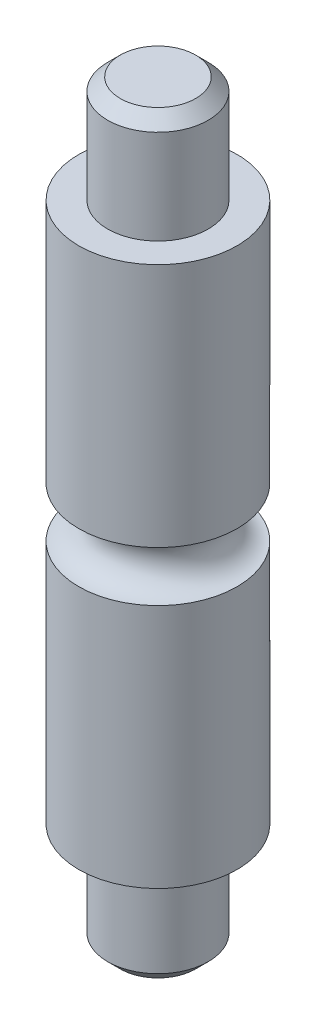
ISO-10303-21;
HEADER;
FILE_DESCRIPTION(('STEP AP214'),'2;1');
FILE_NAME('part.step','',(''),(''),'','','');
FILE_SCHEMA(('AUTOMOTIVE_DESIGN { 1 0 10303 214 1 1 1 1 }'));
ENDSEC;
DATA;
#1=APPLICATION_CONTEXT('core data for automotive mechanical design processes');
#2=APPLICATION_PROTOCOL_DEFINITION('international standard','automotive_design',2000,#1);
#3=PRODUCT_CONTEXT('',#1,'mechanical');
#4=PRODUCT('Part','Part','',(#3));
#5=PRODUCT_RELATED_PRODUCT_CATEGORY('part','',(#4));
#6=PRODUCT_DEFINITION_FORMATION('','',#4);
#7=PRODUCT_DEFINITION_CONTEXT('part definition',#1,'design');
#8=PRODUCT_DEFINITION('design','',#6,#7);
#9=PRODUCT_DEFINITION_SHAPE('','',#8);
#10=(LENGTH_UNIT() NAMED_UNIT(*) SI_UNIT(.MILLI.,.METRE.));
#11=(NAMED_UNIT(*) PLANE_ANGLE_UNIT() SI_UNIT($,.RADIAN.));
#12=(NAMED_UNIT(*) SI_UNIT($,.STERADIAN.) SOLID_ANGLE_UNIT());
#13=UNCERTAINTY_MEASURE_WITH_UNIT(LENGTH_MEASURE(1.E-05),#10,'distance_accuracy_value','');
#14=(GEOMETRIC_REPRESENTATION_CONTEXT(3) GLOBAL_UNCERTAINTY_ASSIGNED_CONTEXT((#13)) GLOBAL_UNIT_ASSIGNED_CONTEXT((#10,
#11,#12)) REPRESENTATION_CONTEXT('',''));
#15=CARTESIAN_POINT('',(0.,0.,0.));
#16=DIRECTION('',(0.,0.,1.));
#17=DIRECTION('',(1.,0.,0.));
#18=AXIS2_PLACEMENT_3D('',#15,#16,#17);
#19=CARTESIAN_POINT('',(0.,-10.75,0.));
#20=DIRECTION('',(0.,1.,0.));
#21=DIRECTION('',(0.,0.,1.));
#22=AXIS2_PLACEMENT_3D('',#19,#20,#21);
#23=CYLINDRICAL_SURFACE('',#22,3.15);
#24=CARTESIAN_POINT('',(0.,-0.999999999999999,0.));
#25=DIRECTION('',(0.,1.,0.));
#26=DIRECTION('',(0.,0.,1.));
#27=AXIS2_PLACEMENT_3D('',#24,#25,#26);
#28=CIRCLE('',#27,3.15);
#29=CARTESIAN_POINT('',(0.,-0.999999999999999,3.15));
#30=VERTEX_POINT('',#29);
#31=EDGE_CURVE('E34',#30,#30,#28,.T.);
#32=ORIENTED_EDGE('',*,*,#31,.F.);
#33=EDGE_LOOP('',(#32));
#34=FACE_BOUND('',#33,.T.);
#35=CARTESIAN_POINT('',(0.,-10.75,0.));
#36=DIRECTION('',(0.,1.,0.));
#37=DIRECTION('',(0.,0.,1.));
#38=AXIS2_PLACEMENT_3D('',#35,#36,#37);
#39=CIRCLE('',#38,3.15);
#40=CARTESIAN_POINT('',(0.,-10.75,3.15));
#41=VERTEX_POINT('',#40);
#42=EDGE_CURVE('E65',#41,#41,#39,.T.);
#43=ORIENTED_EDGE('',*,*,#42,.T.);
#44=EDGE_LOOP('',(#43));
#45=FACE_BOUND('',#44,.T.);
#46=ADVANCED_FACE('F30',(#34,#45),#23,.T.);
#47=CARTESIAN_POINT('',(0.,-10.75,0.));
#48=DIRECTION('',(0.,1.,0.));
#49=DIRECTION('',(0.,0.,1.));
#50=AXIS2_PLACEMENT_3D('',#47,#48,#49);
#51=PLANE('',#50);
#52=CARTESIAN_POINT('',(0.,-10.75,0.));
#53=DIRECTION('',(0.,1.,0.));
#54=DIRECTION('',(0.,0.,1.));
#55=AXIS2_PLACEMENT_3D('',#52,#53,#54);
#56=CIRCLE('',#55,2.);
#57=CARTESIAN_POINT('',(0.,-10.75,2.));
#58=VERTEX_POINT('',#57);
#59=EDGE_CURVE('E51',#58,#58,#56,.T.);
#60=ORIENTED_EDGE('',*,*,#59,.T.);
#61=EDGE_LOOP('',(#60));
#62=FACE_BOUND('',#61,.T.);
#63=ORIENTED_EDGE('',*,*,#42,.F.);
#64=EDGE_LOOP('',(#63));
#65=FACE_BOUND('',#64,.T.);
#66=ADVANCED_FACE('F84',(#62,#65),#51,.F.);
#67=CARTESIAN_POINT('',(0.,-15.,0.));
#68=DIRECTION('',(0.,1.,0.));
#69=DIRECTION('',(0.,0.,1.));
#70=AXIS2_PLACEMENT_3D('',#67,#68,#69);
#71=CYLINDRICAL_SURFACE('',#70,2.);
#72=CARTESIAN_POINT('',(0.,-14.5,0.));
#73=DIRECTION('',(0.,-1.,0.));
#74=DIRECTION('',(0.,0.,-1.));
#75=AXIS2_PLACEMENT_3D('',#72,#73,#74);
#76=CIRCLE('',#75,2.);
#77=CARTESIAN_POINT('',(0.,-14.5,-2.));
#78=VERTEX_POINT('',#77);
#79=EDGE_CURVE('E68',#78,#78,#76,.F.);
#80=ORIENTED_EDGE('',*,*,#79,.T.);
#81=EDGE_LOOP('',(#80));
#82=FACE_BOUND('',#81,.T.);
#83=ORIENTED_EDGE('',*,*,#59,.F.);
#84=EDGE_LOOP('',(#83));
#85=FACE_BOUND('',#84,.T.);
#86=ADVANCED_FACE('F81',(#82,#85),#71,.T.);
#87=CARTESIAN_POINT('',(0.,-15.,0.));
#88=DIRECTION('',(0.,-1.,0.));
#89=DIRECTION('',(0.,0.,1.));
#90=AXIS2_PLACEMENT_3D('',#87,#88,#89);
#91=PLANE('',#90);
#92=CARTESIAN_POINT('',(0.,-15.,0.));
#93=DIRECTION('',(0.,-1.,0.));
#94=DIRECTION('',(0.,0.,-1.));
#95=AXIS2_PLACEMENT_3D('',#92,#93,#94);
#96=CIRCLE('',#95,1.5);
#97=CARTESIAN_POINT('',(0.,-15.,-1.5));
#98=VERTEX_POINT('',#97);
#99=EDGE_CURVE('E43',#98,#98,#96,.T.);
#100=ORIENTED_EDGE('',*,*,#99,.T.);
#101=EDGE_LOOP('',(#100));
#102=FACE_BOUND('',#101,.T.);
#103=ADVANCED_FACE('F73',(#102),#91,.T.);
#104=CARTESIAN_POINT('',(0.,-14.5,0.));
#105=DIRECTION('',(0.,1.,0.));
#106=DIRECTION('',(0.,0.,1.));
#107=AXIS2_PLACEMENT_3D('',#104,#105,#106);
#108=CONICAL_SURFACE('',#107,2.,0.785398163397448);
#109=ORIENTED_EDGE('',*,*,#99,.F.);
#110=EDGE_LOOP('',(#109));
#111=FACE_BOUND('',#110,.T.);
#112=ORIENTED_EDGE('',*,*,#79,.F.);
#113=EDGE_LOOP('',(#112));
#114=FACE_BOUND('',#113,.T.);
#115=ADVANCED_FACE('F75',(#111,#114),#108,.T.);
#116=CARTESIAN_POINT('',(0.,0.,0.));
#117=DIRECTION('',(0.,-1.,0.));
#118=DIRECTION('',(0.,0.,-1.));
#119=AXIS2_PLACEMENT_3D('',#116,#117,#118);
#120=TOROIDAL_SURFACE('',#119,3.15,0.999999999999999);
#121=ORIENTED_EDGE('',*,*,#31,.T.);
#122=EDGE_LOOP('',(#121));
#123=FACE_BOUND('',#122,.T.);
#124=CARTESIAN_POINT('',(0.,0.999999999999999,0.));
#125=DIRECTION('',(0.,-1.,0.));
#126=DIRECTION('',(0.,0.,-1.));
#127=AXIS2_PLACEMENT_3D('',#124,#125,#126);
#128=CIRCLE('',#127,3.15);
#129=CARTESIAN_POINT('',(0.,0.999999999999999,-3.15));
#130=VERTEX_POINT('',#129);
#131=EDGE_CURVE('E46',#130,#130,#128,.T.);
#132=ORIENTED_EDGE('',*,*,#131,.T.);
#133=EDGE_LOOP('',(#132));
#134=FACE_BOUND('',#133,.T.);
#135=ADVANCED_FACE('F78',(#123,#134),#120,.F.);
#136=CARTESIAN_POINT('',(0.,15.,0.));
#137=DIRECTION('',(0.,1.,0.));
#138=DIRECTION('',(0.,0.,1.));
#139=AXIS2_PLACEMENT_3D('',#136,#137,#138);
#140=PLANE('',#139);
#141=CARTESIAN_POINT('',(0.,15.,0.));
#142=DIRECTION('',(0.,1.,0.));
#143=DIRECTION('',(0.,0.,1.));
#144=AXIS2_PLACEMENT_3D('',#141,#142,#143);
#145=CIRCLE('',#144,1.5);
#146=CARTESIAN_POINT('',(0.,15.,1.5));
#147=VERTEX_POINT('',#146);
#148=EDGE_CURVE('E38',#147,#147,#145,.T.);
#149=ORIENTED_EDGE('',*,*,#148,.T.);
#150=EDGE_LOOP('',(#149));
#151=FACE_BOUND('',#150,.T.);
#152=ADVANCED_FACE('F117',(#151),#140,.T.);
#153=CARTESIAN_POINT('',(0.,15.,0.));
#154=DIRECTION('',(0.,-1.,0.));
#155=DIRECTION('',(0.,0.,-1.));
#156=AXIS2_PLACEMENT_3D('',#153,#154,#155);
#157=CONICAL_SURFACE('',#156,1.5,0.785398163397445);
#158=CARTESIAN_POINT('',(0.,14.5,0.));
#159=DIRECTION('',(0.,1.,0.));
#160=DIRECTION('',(0.,0.,1.));
#161=AXIS2_PLACEMENT_3D('',#158,#159,#160);
#162=CIRCLE('',#161,2.);
#163=CARTESIAN_POINT('',(0.,14.5,2.));
#164=VERTEX_POINT('',#163);
#165=EDGE_CURVE('E10',#164,#164,#162,.F.);
#166=ORIENTED_EDGE('',*,*,#165,.F.);
#167=EDGE_LOOP('',(#166));
#168=FACE_BOUND('',#167,.T.);
#169=ORIENTED_EDGE('',*,*,#148,.F.);
#170=EDGE_LOOP('',(#169));
#171=FACE_BOUND('',#170,.T.);
#172=ADVANCED_FACE('F32',(#168,#171),#157,.T.);
#173=CARTESIAN_POINT('',(0.,15.,0.));
#174=DIRECTION('',(0.,-1.,0.));
#175=DIRECTION('',(0.,0.,-1.));
#176=AXIS2_PLACEMENT_3D('',#173,#174,#175);
#177=CYLINDRICAL_SURFACE('',#176,2.);
#178=ORIENTED_EDGE('',*,*,#165,.T.);
#179=EDGE_LOOP('',(#178));
#180=FACE_BOUND('',#179,.T.);
#181=CARTESIAN_POINT('',(0.,10.75,0.));
#182=DIRECTION('',(0.,1.,0.));
#183=DIRECTION('',(0.,0.,1.));
#184=AXIS2_PLACEMENT_3D('',#181,#182,#183);
#185=CIRCLE('',#184,2.);
#186=CARTESIAN_POINT('',(0.,10.75,2.));
#187=VERTEX_POINT('',#186);
#188=EDGE_CURVE('E55',#187,#187,#185,.T.);
#189=ORIENTED_EDGE('',*,*,#188,.T.);
#190=EDGE_LOOP('',(#189));
#191=FACE_BOUND('',#190,.T.);
#192=ADVANCED_FACE('F106',(#180,#191),#177,.T.);
#193=CARTESIAN_POINT('',(0.,10.75,0.));
#194=DIRECTION('',(0.,1.,0.));
#195=DIRECTION('',(0.,0.,1.));
#196=AXIS2_PLACEMENT_3D('',#193,#194,#195);
#197=PLANE('',#196);
#198=ORIENTED_EDGE('',*,*,#188,.F.);
#199=EDGE_LOOP('',(#198));
#200=FACE_BOUND('',#199,.T.);
#201=CARTESIAN_POINT('',(0.,10.75,0.));
#202=DIRECTION('',(0.,1.,0.));
#203=DIRECTION('',(0.,0.,1.));
#204=AXIS2_PLACEMENT_3D('',#201,#202,#203);
#205=CIRCLE('',#204,3.15);
#206=CARTESIAN_POINT('',(0.,10.75,3.15));
#207=VERTEX_POINT('',#206);
#208=EDGE_CURVE('E60',#207,#207,#205,.T.);
#209=ORIENTED_EDGE('',*,*,#208,.T.);
#210=EDGE_LOOP('',(#209));
#211=FACE_BOUND('',#210,.T.);
#212=ADVANCED_FACE('F101',(#200,#211),#197,.T.);
#213=ORIENTED_EDGE('',*,*,#131,.F.);
#214=EDGE_LOOP('',(#213));
#215=FACE_BOUND('',#214,.T.);
#216=ORIENTED_EDGE('',*,*,#208,.F.);
#217=EDGE_LOOP('',(#216));
#218=FACE_BOUND('',#217,.T.);
#219=ADVANCED_FACE('F96',(#215,#218),#23,.T.);
#220=CLOSED_SHELL('',(#46,#66,#86,#103,#115,#135,#152,#172,#192,#212,#219));
#221=MANIFOLD_SOLID_BREP('B2',#220);
#222=ADVANCED_BREP_SHAPE_REPRESENTATION('',(#18,#221),#14);
#223=SHAPE_DEFINITION_REPRESENTATION(#9,#222);
ENDSEC;
END-ISO-10303-21;
